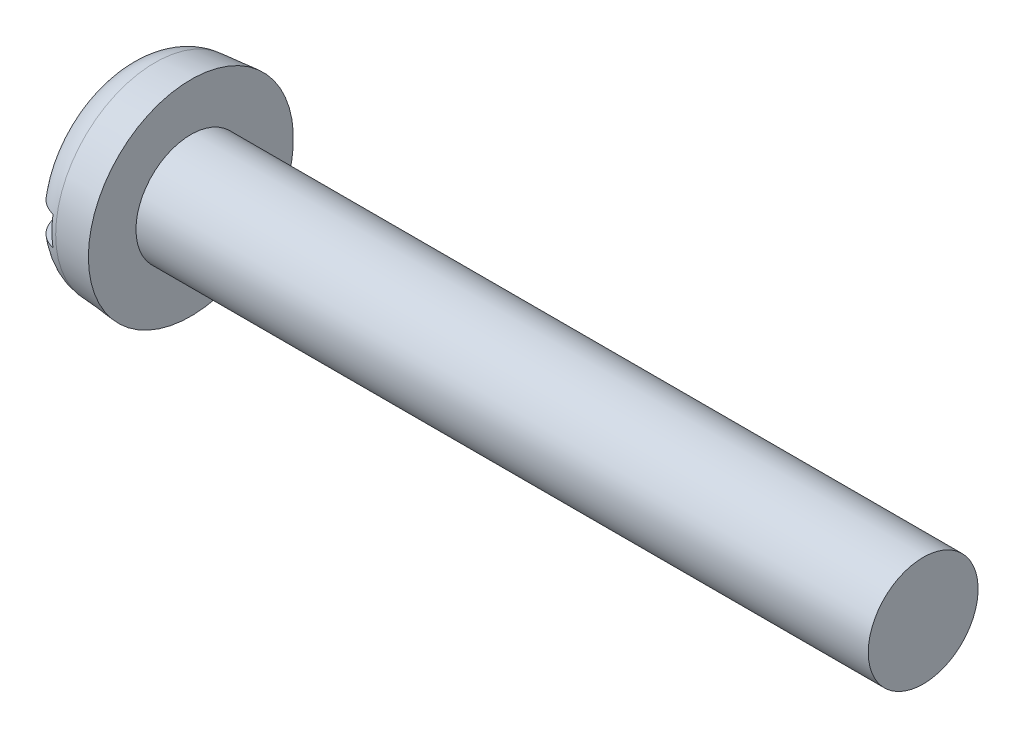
ISO-10303-21;
HEADER;
FILE_DESCRIPTION(('STEP AP214'),'2;1');
FILE_NAME('part.step','',(''),(''),'','','');
FILE_SCHEMA(('AUTOMOTIVE_DESIGN { 1 0 10303 214 1 1 1 1 }'));
ENDSEC;
DATA;
#1=APPLICATION_CONTEXT('core data for automotive mechanical design processes');
#2=APPLICATION_PROTOCOL_DEFINITION('international standard','automotive_design',2000,#1);
#3=PRODUCT_CONTEXT('',#1,'mechanical');
#4=PRODUCT('Part','Part','',(#3));
#5=PRODUCT_RELATED_PRODUCT_CATEGORY('part','',(#4));
#6=PRODUCT_DEFINITION_FORMATION('','',#4);
#7=PRODUCT_DEFINITION_CONTEXT('part definition',#1,'design');
#8=PRODUCT_DEFINITION('design','',#6,#7);
#9=PRODUCT_DEFINITION_SHAPE('','',#8);
#10=(LENGTH_UNIT() NAMED_UNIT(*) SI_UNIT(.MILLI.,.METRE.));
#11=(NAMED_UNIT(*) PLANE_ANGLE_UNIT() SI_UNIT($,.RADIAN.));
#12=(NAMED_UNIT(*) SI_UNIT($,.STERADIAN.) SOLID_ANGLE_UNIT());
#13=UNCERTAINTY_MEASURE_WITH_UNIT(LENGTH_MEASURE(1.E-05),#10,'distance_accuracy_value','');
#14=(GEOMETRIC_REPRESENTATION_CONTEXT(3) GLOBAL_UNCERTAINTY_ASSIGNED_CONTEXT((#13)) GLOBAL_UNIT_ASSIGNED_CONTEXT((#10,
#11,#12)) REPRESENTATION_CONTEXT('',''));
#15=CARTESIAN_POINT('',(0.,0.,0.));
#16=DIRECTION('',(0.,0.,1.));
#17=DIRECTION('',(1.,0.,0.));
#18=AXIS2_PLACEMENT_3D('',#15,#16,#17);
#19=CARTESIAN_POINT('',(0.,0.,0.));
#20=DIRECTION('',(-1.,0.,0.));
#21=DIRECTION('',(0.,0.,1.));
#22=AXIS2_PLACEMENT_3D('',#19,#20,#21);
#23=PLANE('',#22);
#24=DIRECTION('',(0.,0.,-1.));
#25=VECTOR('',#24,1.);
#26=CARTESIAN_POINT('',(0.,0.399999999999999,2.8));
#27=LINE('',#26,#25);
#28=CARTESIAN_POINT('',(0.,0.399999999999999,1.77326763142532));
#29=VERTEX_POINT('',#28);
#30=CARTESIAN_POINT('',(0.,0.399999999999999,-1.77326763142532));
#31=VERTEX_POINT('',#30);
#32=EDGE_CURVE('E85',#29,#31,#27,.T.);
#33=ORIENTED_EDGE('',*,*,#32,.F.);
#34=CARTESIAN_POINT('',(0.,0.,0.));
#35=DIRECTION('',(-1.,0.,0.));
#36=DIRECTION('',(0.,0.,1.));
#37=AXIS2_PLACEMENT_3D('',#34,#35,#36);
#38=CIRCLE('',#37,1.81782234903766);
#39=EDGE_CURVE('E91',#29,#31,#38,.T.);
#40=ORIENTED_EDGE('',*,*,#39,.T.);
#41=EDGE_LOOP('',(#33,#40));
#42=FACE_BOUND('',#41,.T.);
#43=ADVANCED_FACE('F32',(#42),#23,.T.);
#44=CARTESIAN_POINT('',(-25.4,0.,0.));
#45=DIRECTION('',(-1.,0.,0.));
#46=DIRECTION('',(0.,0.,1.));
#47=AXIS2_PLACEMENT_3D('',#44,#45,#46);
#48=CYLINDRICAL_SURFACE('',#47,1.5);
#49=CARTESIAN_POINT('',(21.8,0.,0.));
#50=DIRECTION('',(-1.,0.,0.));
#51=DIRECTION('',(0.,0.,1.));
#52=AXIS2_PLACEMENT_3D('',#49,#50,#51);
#53=CIRCLE('',#52,1.5);
#54=CARTESIAN_POINT('',(21.8,0.,1.5));
#55=VERTEX_POINT('',#54);
#56=EDGE_CURVE('E92',#55,#55,#53,.T.);
#57=ORIENTED_EDGE('',*,*,#56,.T.);
#58=EDGE_LOOP('',(#57));
#59=FACE_BOUND('',#58,.T.);
#60=CARTESIAN_POINT('',(1.8,0.,0.));
#61=DIRECTION('',(-1.,0.,0.));
#62=DIRECTION('',(0.,0.,1.));
#63=AXIS2_PLACEMENT_3D('',#60,#61,#62);
#64=CIRCLE('',#63,1.5);
#65=CARTESIAN_POINT('',(1.8,0.,1.5));
#66=VERTEX_POINT('',#65);
#67=EDGE_CURVE('E149',#66,#66,#64,.T.);
#68=ORIENTED_EDGE('',*,*,#67,.F.);
#69=EDGE_LOOP('',(#68));
#70=FACE_BOUND('',#69,.T.);
#71=ADVANCED_FACE('F137',(#59,#70),#48,.T.);
#72=CARTESIAN_POINT('',(21.8,1.5,0.));
#73=DIRECTION('',(1.,0.,0.));
#74=DIRECTION('',(0.,0.,-1.));
#75=AXIS2_PLACEMENT_3D('',#72,#73,#74);
#76=PLANE('',#75);
#77=ORIENTED_EDGE('',*,*,#56,.F.);
#78=EDGE_LOOP('',(#77));
#79=FACE_BOUND('',#78,.T.);
#80=ADVANCED_FACE('F135',(#79),#76,.T.);
#81=DIRECTION('',(0.,0.,1.));
#82=VECTOR('',#81,1.);
#83=CARTESIAN_POINT('',(0.,-0.4,-2.8));
#84=LINE('',#83,#82);
#85=CARTESIAN_POINT('',(0.,-0.4,-1.77326763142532));
#86=VERTEX_POINT('',#85);
#87=CARTESIAN_POINT('',(0.,-0.4,1.77326763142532));
#88=VERTEX_POINT('',#87);
#89=EDGE_CURVE('E76',#86,#88,#84,.T.);
#90=ORIENTED_EDGE('',*,*,#89,.F.);
#91=EDGE_CURVE('E83',#86,#88,#38,.T.);
#92=ORIENTED_EDGE('',*,*,#91,.T.);
#93=EDGE_LOOP('',(#90,#92));
#94=FACE_BOUND('',#93,.T.);
#95=ADVANCED_FACE('F82',(#94),#23,.T.);
#96=CARTESIAN_POINT('',(0.,0.,0.));
#97=DIRECTION('',(1.,0.,0.));
#98=DIRECTION('',(0.,0.,-1.));
#99=AXIS2_PLACEMENT_3D('',#96,#97,#98);
#100=CONICAL_SURFACE('',#99,2.64252040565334,0.087266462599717);
#101=CARTESIAN_POINT('',(0.821559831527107,0.,0.));
#102=DIRECTION('',(-1.,0.,0.));
#103=DIRECTION('',(0.,0.,1.));
#104=AXIS2_PLACEMENT_3D('',#101,#102,#103);
#105=CIRCLE('',#104,2.71439757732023);
#106=CARTESIAN_POINT('',(0.821559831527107,0.,2.71439757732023));
#107=VERTEX_POINT('',#106);
#108=EDGE_CURVE('E95',#107,#107,#105,.F.);
#109=ORIENTED_EDGE('',*,*,#108,.T.);
#110=EDGE_LOOP('',(#109));
#111=FACE_BOUND('',#110,.T.);
#112=CARTESIAN_POINT('',(1.8,0.,0.));
#113=DIRECTION('',(-1.,0.,0.));
#114=DIRECTION('',(0.,0.,1.));
#115=AXIS2_PLACEMENT_3D('',#112,#113,#114);
#116=CIRCLE('',#115,2.8);
#117=CARTESIAN_POINT('',(1.8,0.,2.8));
#118=VERTEX_POINT('',#117);
#119=EDGE_CURVE('E97',#118,#118,#116,.T.);
#120=ORIENTED_EDGE('',*,*,#119,.T.);
#121=EDGE_LOOP('',(#120));
#122=FACE_BOUND('',#121,.T.);
#123=ADVANCED_FACE('F128',(#111,#122),#100,.T.);
#124=CARTESIAN_POINT('',(1.8,1.5,0.));
#125=DIRECTION('',(-1.,0.,0.));
#126=DIRECTION('',(0.,0.,1.));
#127=AXIS2_PLACEMENT_3D('',#124,#125,#126);
#128=PLANE('',#127);
#129=ORIENTED_EDGE('',*,*,#119,.F.);
#130=EDGE_LOOP('',(#129));
#131=FACE_BOUND('',#130,.T.);
#132=ORIENTED_EDGE('',*,*,#67,.T.);
#133=EDGE_LOOP('',(#132));
#134=FACE_BOUND('',#133,.T.);
#135=ADVANCED_FACE('F124',(#131,#134),#128,.F.);
#136=CARTESIAN_POINT('',(0.9,0.,0.));
#137=DIRECTION('',(-1.,0.,0.));
#138=DIRECTION('',(0.,0.,1.));
#139=AXIS2_PLACEMENT_3D('',#136,#137,#138);
#140=TOROIDAL_SURFACE('',#139,1.81782234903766,0.9);
#141=CARTESIAN_POINT('',(0.285780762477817,0.399999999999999,-2.44311963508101));
#142=CARTESIAN_POINT('',(0.322325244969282,0.399999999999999,-2.47769297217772));
#143=CARTESIAN_POINT('',(0.361794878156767,0.399999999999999,-2.50922544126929));
#144=CARTESIAN_POINT('',(0.445493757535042,0.399999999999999,-2.56525291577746));
#145=CARTESIAN_POINT('',(0.48972822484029,0.399999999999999,-2.58974009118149));
#146=CARTESIAN_POINT('',(0.581685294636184,0.399999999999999,-2.63091846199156));
#147=CARTESIAN_POINT('',(0.629407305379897,0.399999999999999,-2.64761097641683));
#148=CARTESIAN_POINT('',(0.726972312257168,0.399999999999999,-2.67270033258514));
#149=CARTESIAN_POINT('',(0.776814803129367,0.399999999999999,-2.68109913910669));
#150=CARTESIAN_POINT('',(0.876977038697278,0.399999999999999,-2.68933922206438));
#151=CARTESIAN_POINT('',(0.92729364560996,0.399999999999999,-2.68921866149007));
#152=CARTESIAN_POINT('',(1.02719093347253,0.399999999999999,-2.68051830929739));
#153=CARTESIAN_POINT('',(1.07677160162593,0.399999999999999,-2.67193837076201));
#154=CARTESIAN_POINT('',(1.17371760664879,0.399999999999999,-2.6465919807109));
#155=CARTESIAN_POINT('',(1.2210859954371,0.399999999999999,-2.62983719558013));
#156=CARTESIAN_POINT('',(1.31235127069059,0.399999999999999,-2.58864040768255));
#157=CARTESIAN_POINT('',(1.35624813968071,0.399999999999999,-2.56419836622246));
#158=CARTESIAN_POINT('',(1.43950339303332,0.399999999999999,-2.50824069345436));
#159=CARTESIAN_POINT('',(1.47884484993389,0.399999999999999,-2.47669988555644));
#160=CARTESIAN_POINT('',(1.55173067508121,0.399999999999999,-2.40751412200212));
#161=CARTESIAN_POINT('',(1.5852748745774,0.399999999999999,-2.36986898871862));
#162=CARTESIAN_POINT('',(1.64594872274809,0.399999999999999,-2.28919528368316));
#163=CARTESIAN_POINT('',(1.67301846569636,0.399999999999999,-2.24612167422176));
#164=CARTESIAN_POINT('',(1.71966197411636,0.399999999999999,-2.15609376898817));
#165=CARTESIAN_POINT('',(1.73923530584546,0.399999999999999,-2.10913924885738));
#166=CARTESIAN_POINT('',(1.77066025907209,0.399999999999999,-2.01194193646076));
#167=CARTESIAN_POINT('',(1.78239254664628,0.399999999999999,-1.96166058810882));
#168=CARTESIAN_POINT('',(1.7974373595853,0.399999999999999,-1.85985639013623));
#169=CARTESIAN_POINT('',(1.80074908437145,0.399999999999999,-1.80833342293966));
#170=CARTESIAN_POINT('',(1.79894832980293,0.399999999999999,-1.70434405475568));
#171=CARTESIAN_POINT('',(1.79365584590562,0.399999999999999,-1.651880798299));
#172=CARTESIAN_POINT('',(1.77456092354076,0.399999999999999,-1.54852841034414));
#173=CARTESIAN_POINT('',(1.76075741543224,0.399999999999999,-1.49763947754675));
#174=CARTESIAN_POINT('',(1.7246504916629,0.399999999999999,-1.3975266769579));
#175=CARTESIAN_POINT('',(1.70214283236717,0.399999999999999,-1.34837644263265));
#176=CARTESIAN_POINT('',(1.64933120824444,0.399999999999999,-1.25444995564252));
#177=CARTESIAN_POINT('',(1.6190255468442,0.399999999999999,-1.20967465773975));
#178=CARTESIAN_POINT('',(1.55085214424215,0.399999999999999,-1.12504927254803));
#179=CARTESIAN_POINT('',(1.51286662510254,0.399999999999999,-1.08529386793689));
#180=CARTESIAN_POINT('',(1.4306134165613,0.399999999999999,-1.01288372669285));
#181=CARTESIAN_POINT('',(1.38634513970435,0.399999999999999,-0.980229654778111));
#182=CARTESIAN_POINT('',(1.29378824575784,0.399999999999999,-0.924048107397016));
#183=CARTESIAN_POINT('',(1.24562231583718,0.399999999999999,-0.900319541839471));
#184=CARTESIAN_POINT('',(1.14574424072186,0.399999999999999,-0.862177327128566));
#185=CARTESIAN_POINT('',(1.09403573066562,0.399999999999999,-0.847754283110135));
#186=CARTESIAN_POINT('',(0.993395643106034,0.399999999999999,-0.830011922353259));
#187=CARTESIAN_POINT('',(0.944615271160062,0.399999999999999,-0.825833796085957));
#188=CARTESIAN_POINT('',(0.847107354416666,0.399999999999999,-0.826334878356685));
#189=CARTESIAN_POINT('',(0.798379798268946,0.399999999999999,-0.831011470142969));
#190=CARTESIAN_POINT('',(0.705495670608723,0.399999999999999,-0.848340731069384));
#191=CARTESIAN_POINT('',(0.661242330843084,0.399999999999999,-0.860484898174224));
#192=CARTESIAN_POINT('',(0.575232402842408,0.399999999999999,-0.891650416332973));
#193=CARTESIAN_POINT('',(0.53347652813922,0.399999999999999,-0.910673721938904));
#194=CARTESIAN_POINT('',(0.451191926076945,0.399999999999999,-0.956010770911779));
#195=CARTESIAN_POINT('',(0.410848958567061,0.399999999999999,-0.982660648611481));
#196=CARTESIAN_POINT('',(0.334722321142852,0.399999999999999,-1.04182188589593));
#197=CARTESIAN_POINT('',(0.298940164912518,0.399999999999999,-1.0743351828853));
#198=CARTESIAN_POINT('',(0.229649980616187,0.399999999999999,-1.14749226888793));
#199=CARTESIAN_POINT('',(0.19663491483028,0.399999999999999,-1.18860403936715));
#200=CARTESIAN_POINT('',(0.137645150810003,0.399999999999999,-1.27560624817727));
#201=CARTESIAN_POINT('',(0.111672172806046,0.399999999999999,-1.32149785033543));
#202=CARTESIAN_POINT('',(0.0665593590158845,0.399999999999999,-1.41881690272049));
#203=CARTESIAN_POINT('',(0.0477401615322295,0.399999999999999,-1.47039354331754));
#204=CARTESIAN_POINT('',(0.0191028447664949,0.399999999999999,-1.57598967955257));
#205=CARTESIAN_POINT('',(0.0092842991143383,0.399999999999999,-1.63000905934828));
#206=CARTESIAN_POINT('',(-0.000908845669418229,0.399999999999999,-1.73850050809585));
#207=CARTESIAN_POINT('',(-0.00135843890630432,0.399999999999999,-1.7929654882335));
#208=CARTESIAN_POINT('',(0.00713794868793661,0.399999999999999,-1.90117587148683));
#209=CARTESIAN_POINT('',(0.0160852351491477,0.399999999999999,-1.9549211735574));
#210=CARTESIAN_POINT('',(0.0428869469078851,0.399999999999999,-2.05874477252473));
#211=CARTESIAN_POINT('',(0.0605196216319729,0.399999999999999,-2.10888044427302));
#212=CARTESIAN_POINT('',(0.104140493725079,0.399999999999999,-2.20532358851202));
#213=CARTESIAN_POINT('',(0.130117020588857,0.399999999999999,-2.25163629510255));
#214=CARTESIAN_POINT('',(0.178150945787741,0.399999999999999,-2.32211375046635));
#215=CARTESIAN_POINT('',(0.197843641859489,0.399999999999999,-2.34792122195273));
#216=CARTESIAN_POINT('',(0.239879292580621,0.399999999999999,-2.39728022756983));
#217=CARTESIAN_POINT('',(0.26222221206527,0.399999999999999,-2.42083179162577));
#218=CARTESIAN_POINT('',(0.285780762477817,0.399999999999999,-2.44311963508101));
#219=B_SPLINE_CURVE_WITH_KNOTS('',3,(#141,#142,#143,#144,#145,#146,#147,#148,#149,#150,#151,
#152,#153,#154,#155,#156,#157,#158,#159,#160,#161,#162,#163,#164,#165,#166,#167,#168,#169,#170,
#171,#172,#173,#174,#175,#176,#177,#178,#179,#180,#181,#182,#183,#184,#185,#186,#187,#188,#189,
#190,#191,#192,#193,#194,#195,#196,#197,#198,#199,#200,#201,#202,#203,#204,#205,#206,#207,#208,
#209,#210,#211,#212,#213,#214,#215,#216,#217,#218),.UNSPECIFIED.,.T.,.F.,(4,2,2,2,2,2,2,2,2,2,2,
2,2,2,2,2,2,2,2,2,2,2,2,2,2,2,2,2,2,2,2,2,2,2,2,2,2,2,4),(0.,0.15080428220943,0.301775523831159,
0.452721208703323,0.603631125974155,0.753865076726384,0.904101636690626,1.05412441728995,
1.2041479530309,1.35471219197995,1.50528081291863,1.65719291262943,1.80911380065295,
1.96329712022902,2.11749509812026,2.27496068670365,2.43244606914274,2.59387611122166,
2.75534130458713,2.9195015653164,3.08367718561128,3.24389389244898,3.40394859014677,
3.55004213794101,3.69609251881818,3.83315592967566,3.97025831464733,4.11470991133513,
4.25920932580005,4.41668805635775,4.57420522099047,4.73812462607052,4.90203626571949,
5.06463536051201,5.22725705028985,5.38592661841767,5.54437521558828,5.64159310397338,
5.73880970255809),.UNSPECIFIED.);
#220=CARTESIAN_POINT('',(0.7,0.399999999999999,-2.66547244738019));
#221=VERTEX_POINT('',#220);
#222=EDGE_CURVE('E11',#31,#221,#219,.T.);
#223=ORIENTED_EDGE('',*,*,#222,.F.);
#224=ORIENTED_EDGE('',*,*,#39,.F.);
#225=CARTESIAN_POINT('',(0.356169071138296,0.399999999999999,1.02545886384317));
#226=CARTESIAN_POINT('',(0.394477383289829,0.399999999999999,0.994276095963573));
#227=CARTESIAN_POINT('',(0.435252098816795,0.399999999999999,0.966090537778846));
#228=CARTESIAN_POINT('',(0.520874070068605,0.399999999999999,0.916713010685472));
#229=CARTESIAN_POINT('',(0.56572297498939,0.399999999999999,0.895523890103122));
#230=CARTESIAN_POINT('',(0.658585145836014,0.399999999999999,0.861072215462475));
#231=CARTESIAN_POINT('',(0.706609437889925,0.399999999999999,0.84783908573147));
#232=CARTESIAN_POINT('',(0.80424325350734,0.399999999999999,0.83024223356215));
#233=CARTESIAN_POINT('',(0.853851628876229,0.399999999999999,0.825872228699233));
#234=CARTESIAN_POINT('',(0.950010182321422,0.399999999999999,0.826277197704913));
#235=CARTESIAN_POINT('',(0.99656347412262,0.399999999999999,0.830513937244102));
#236=CARTESIAN_POINT('',(1.08828168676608,0.399999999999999,0.846797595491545));
#237=CARTESIAN_POINT('',(1.1334463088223,0.399999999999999,0.858846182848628));
#238=CARTESIAN_POINT('',(1.22099947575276,0.399999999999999,0.890027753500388));
#239=CARTESIAN_POINT('',(1.26339999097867,0.399999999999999,0.909127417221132));
#240=CARTESIAN_POINT('',(1.34475562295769,0.399999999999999,0.953613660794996));
#241=CARTESIAN_POINT('',(1.38370973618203,0.399999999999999,0.979002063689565));
#242=CARTESIAN_POINT('',(1.4606297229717,0.399999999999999,1.03768873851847));
#243=CARTESIAN_POINT('',(1.49821861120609,0.399999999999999,1.07148126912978));
#244=CARTESIAN_POINT('',(1.56766557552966,0.399999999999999,1.14451739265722));
#245=CARTESIAN_POINT('',(1.59952174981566,0.399999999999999,1.18376278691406));
#246=CARTESIAN_POINT('',(1.65882951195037,0.399999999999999,1.26965174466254));
#247=CARTESIAN_POINT('',(1.68580874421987,0.399999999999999,1.3166225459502));
#248=CARTESIAN_POINT('',(1.7316261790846,0.399999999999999,1.41438438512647));
#249=CARTESIAN_POINT('',(1.7504634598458,0.399999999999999,1.46517585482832));
#250=CARTESIAN_POINT('',(1.77959171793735,0.399999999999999,1.56990546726));
#251=CARTESIAN_POINT('',(1.78976336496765,0.399999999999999,1.62387693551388));
#252=CARTESIAN_POINT('',(1.80070617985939,0.399999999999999,1.73276786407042));
#253=CARTESIAN_POINT('',(1.80147810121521,0.399999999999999,1.78768724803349));
#254=CARTESIAN_POINT('',(1.7935515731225,0.399999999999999,1.89576039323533));
#255=CARTESIAN_POINT('',(1.78503812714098,0.399999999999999,1.94892767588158));
#256=CARTESIAN_POINT('',(1.75897009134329,0.399999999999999,2.05299963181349));
#257=CARTESIAN_POINT('',(1.74141670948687,0.399999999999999,2.10390460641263));
#258=CARTESIAN_POINT('',(1.69825810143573,0.399999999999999,2.20064023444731));
#259=CARTESIAN_POINT('',(1.67286703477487,0.399999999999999,2.24656646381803));
#260=CARTESIAN_POINT('',(1.61458416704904,0.399999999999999,2.33338474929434));
#261=CARTESIAN_POINT('',(1.58169323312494,0.399999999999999,2.37427738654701));
#262=CARTESIAN_POINT('',(1.51007060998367,0.399999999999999,2.44900649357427));
#263=CARTESIAN_POINT('',(1.47146964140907,0.399999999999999,2.48296829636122));
#264=CARTESIAN_POINT('',(1.38904817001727,0.399999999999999,2.54382334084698));
#265=CARTESIAN_POINT('',(1.34522808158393,0.399999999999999,2.57071714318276));
#266=CARTESIAN_POINT('',(1.25424836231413,0.399999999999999,2.61630908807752));
#267=CARTESIAN_POINT('',(1.20714119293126,0.399999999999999,2.63511196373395));
#268=CARTESIAN_POINT('',(1.11042474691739,0.399999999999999,2.66447616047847));
#269=CARTESIAN_POINT('',(1.06081558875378,0.399999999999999,2.67503787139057));
#270=CARTESIAN_POINT('',(0.960893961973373,0.399999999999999,2.68755622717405));
#271=CARTESIAN_POINT('',(0.910589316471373,0.399999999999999,2.68957539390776));
#272=CARTESIAN_POINT('',(0.810358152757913,0.399999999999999,2.68512046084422));
#273=CARTESIAN_POINT('',(0.760431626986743,0.399999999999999,2.67864653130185));
#274=CARTESIAN_POINT('',(0.662478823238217,0.399999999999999,2.65741995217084));
#275=CARTESIAN_POINT('',(0.614448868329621,0.399999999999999,2.64268425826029));
#276=CARTESIAN_POINT('',(0.521534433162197,0.399999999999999,2.60538142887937));
#277=CARTESIAN_POINT('',(0.476649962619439,0.399999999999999,2.58281426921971));
#278=CARTESIAN_POINT('',(0.391148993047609,0.399999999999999,2.53043182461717));
#279=CARTESIAN_POINT('',(0.350545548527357,0.399999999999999,2.50059523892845));
#280=CARTESIAN_POINT('',(0.274874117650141,0.399999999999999,2.43457977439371));
#281=CARTESIAN_POINT('',(0.239806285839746,0.399999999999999,2.39840071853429));
#282=CARTESIAN_POINT('',(0.1758792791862,0.399999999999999,2.32042102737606));
#283=CARTESIAN_POINT('',(0.147073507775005,0.399999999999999,2.27857662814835));
#284=CARTESIAN_POINT('',(0.0967847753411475,0.399999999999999,2.19069995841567));
#285=CARTESIAN_POINT('',(0.07530224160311,0.399999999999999,2.14466744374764));
#286=CARTESIAN_POINT('',(0.0399276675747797,0.399999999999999,2.04903409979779));
#287=CARTESIAN_POINT('',(0.0261471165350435,0.399999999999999,1.99939205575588));
#288=CARTESIAN_POINT('',(0.00693602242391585,0.399999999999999,1.89852251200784));
#289=CARTESIAN_POINT('',(0.00150590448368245,0.399999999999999,1.84729493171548));
#290=CARTESIAN_POINT('',(-0.000985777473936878,0.399999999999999,1.74359522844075));
#291=CARTESIAN_POINT('',(0.0021251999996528,0.399999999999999,1.69111899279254));
#292=CARTESIAN_POINT('',(0.0168916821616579,0.399999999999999,1.58737297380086));
#293=CARTESIAN_POINT('',(0.0285499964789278,0.399999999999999,1.53610359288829));
#294=CARTESIAN_POINT('',(0.0604020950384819,0.399999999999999,1.43486374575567));
#295=CARTESIAN_POINT('',(0.080804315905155,0.399999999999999,1.38495893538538));
#296=CARTESIAN_POINT('',(0.129530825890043,0.399999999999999,1.28921347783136));
#297=CARTESIAN_POINT('',(0.157849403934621,0.399999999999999,1.24336993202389));
#298=CARTESIAN_POINT('',(0.213684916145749,0.399999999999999,1.16773658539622));
#299=CARTESIAN_POINT('',(0.239651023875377,0.399999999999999,1.13678903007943));
#300=CARTESIAN_POINT('',(0.29525297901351,0.399999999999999,1.07838116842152));
#301=CARTESIAN_POINT('',(0.324888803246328,0.399999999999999,1.05092084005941));
#302=CARTESIAN_POINT('',(0.356169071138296,0.399999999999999,1.02545886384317));
#303=B_SPLINE_CURVE_WITH_KNOTS('',3,(#225,#226,#227,#228,#229,#230,#231,#232,#233,#234,#235,
#236,#237,#238,#239,#240,#241,#242,#243,#244,#245,#246,#247,#248,#249,#250,#251,#252,#253,#254,
#255,#256,#257,#258,#259,#260,#261,#262,#263,#264,#265,#266,#267,#268,#269,#270,#271,#272,#273,
#274,#275,#276,#277,#278,#279,#280,#281,#282,#283,#284,#285,#286,#287,#288,#289,#290,#291,#292,
#293,#294,#295,#296,#297,#298,#299,#300,#301,#302),.UNSPECIFIED.,.T.,.F.,(4,2,2,2,2,2,2,2,2,2,2,
2,2,2,2,2,2,2,2,2,2,2,2,2,2,2,2,2,2,2,2,2,2,2,2,2,2,2,4),(0.,0.148056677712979,
0.296173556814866,0.444834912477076,0.593390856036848,0.732942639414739,0.87252424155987,
1.01145452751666,1.15042513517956,1.30141738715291,1.45245963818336,1.61420969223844,
1.7759780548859,1.93993961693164,2.10388803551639,2.26462860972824,2.42534771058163,
2.58201478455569,2.73866375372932,2.89216335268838,3.04565077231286,3.19708679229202,
3.34851564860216,3.49883427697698,3.64914989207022,3.79915813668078,3.94916684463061,
4.09962050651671,4.25007836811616,4.40177296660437,4.55347641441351,4.70732244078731,
4.86117629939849,5.0181609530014,5.17519723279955,5.33620557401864,5.49709805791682,
5.61799301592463,5.73888721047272),.UNSPECIFIED.);
#304=CARTESIAN_POINT('',(0.7,0.399999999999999,2.66547244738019));
#305=VERTEX_POINT('',#304);
#306=EDGE_CURVE('E109',#305,#29,#303,.T.);
#307=ORIENTED_EDGE('',*,*,#306,.F.);
#308=CARTESIAN_POINT('',(0.7,0.,0.));
#309=DIRECTION('',(-1.,0.,0.));
#310=DIRECTION('',(0.,0.,1.));
#311=AXIS2_PLACEMENT_3D('',#308,#309,#310);
#312=CIRCLE('',#311,2.69531878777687);
#313=CARTESIAN_POINT('',(0.7,-0.4,2.66547244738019));
#314=VERTEX_POINT('',#313);
#315=EDGE_CURVE('E103',#305,#314,#312,.F.);
#316=ORIENTED_EDGE('',*,*,#315,.T.);
#317=CARTESIAN_POINT('',(0.356169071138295,-0.4,1.02545886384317));
#318=CARTESIAN_POINT('',(0.314031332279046,-0.4,1.05976167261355));
#319=CARTESIAN_POINT('',(0.274819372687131,-0.4,1.0977427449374));
#320=CARTESIAN_POINT('',(0.20326819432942,-0.4,1.17978565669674));
#321=CARTESIAN_POINT('',(0.170942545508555,-0.4,1.22385922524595));
#322=CARTESIAN_POINT('',(0.114111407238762,-0.4,1.31672727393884));
#323=CARTESIAN_POINT('',(0.0895968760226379,-0.4,1.36551620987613));
#324=CARTESIAN_POINT('',(0.0490785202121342,-0.4,1.46648183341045));
#325=CARTESIAN_POINT('',(0.0330703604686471,-0.4,1.51865678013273));
#326=CARTESIAN_POINT('',(0.0100453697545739,-0.4,1.62518908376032));
#327=CARTESIAN_POINT('',(0.00306618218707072,-0.4,1.67955460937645));
#328=CARTESIAN_POINT('',(-0.00144685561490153,-0.4,1.78868546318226));
#329=CARTESIAN_POINT('',(0.00101939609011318,-0.4,1.84345079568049));
#330=CARTESIAN_POINT('',(0.0152891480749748,-0.4,1.95052330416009));
#331=CARTESIAN_POINT('',(0.0268854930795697,-0.4,2.0028580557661));
#332=CARTESIAN_POINT('',(0.0589248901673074,-0.4,2.10474672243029));
#333=CARTESIAN_POINT('',(0.0793666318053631,-0.4,2.15430104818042));
#334=CARTESIAN_POINT('',(0.12795627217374,-0.4,2.24792186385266));
#335=CARTESIAN_POINT('',(0.155901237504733,-0.4,2.29209371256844));
#336=CARTESIAN_POINT('',(0.218944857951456,-0.4,2.37499861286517));
#337=CARTESIAN_POINT('',(0.254042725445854,-0.4,2.41373226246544));
#338=CARTESIAN_POINT('',(0.32966685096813,-0.4,2.48389534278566));
#339=CARTESIAN_POINT('',(0.370077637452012,-0.4,2.51544927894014));
#340=CARTESIAN_POINT('',(0.455677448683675,-0.4,2.57122459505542));
#341=CARTESIAN_POINT('',(0.500866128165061,-0.4,2.59544650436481));
#342=CARTESIAN_POINT('',(0.59413782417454,-0.4,2.6355729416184));
#343=CARTESIAN_POINT('',(0.642178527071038,-0.4,2.65157587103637));
#344=CARTESIAN_POINT('',(0.740273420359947,-0.4,2.67523109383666));
#345=CARTESIAN_POINT('',(0.790327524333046,-0.4,2.68288374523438));
#346=CARTESIAN_POINT('',(0.890686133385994,-0.4,2.68958762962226));
#347=CARTESIAN_POINT('',(0.940986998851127,-0.4,2.68869347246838));
#348=CARTESIAN_POINT('',(1.04072178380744,-0.4,2.67846167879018));
#349=CARTESIAN_POINT('',(1.0901557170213,-0.4,2.66912417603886));
#350=CARTESIAN_POINT('',(1.18669599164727,-0.4,2.64229877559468));
#351=CARTESIAN_POINT('',(1.23380501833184,-0.4,2.6248205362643));
#352=CARTESIAN_POINT('',(1.32443528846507,-0.4,2.58223220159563));
#353=CARTESIAN_POINT('',(1.36795650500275,-0.4,2.5571220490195));
#354=CARTESIAN_POINT('',(1.45036421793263,-0.4,2.49989362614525));
#355=CARTESIAN_POINT('',(1.48923230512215,-0.4,2.46774885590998));
#356=CARTESIAN_POINT('',(1.56107927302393,-0.4,2.39744378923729));
#357=CARTESIAN_POINT('',(1.59405796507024,-0.4,2.35928330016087));
#358=CARTESIAN_POINT('',(1.65352847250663,-0.4,2.2776666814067));
#359=CARTESIAN_POINT('',(1.67995797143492,-0.4,2.23416516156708));
#360=CARTESIAN_POINT('',(1.72526137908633,-0.4,2.14339421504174));
#361=CARTESIAN_POINT('',(1.74413484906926,-0.4,2.09612456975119));
#362=CARTESIAN_POINT('',(1.77411508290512,-0.4,1.9983989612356));
#363=CARTESIAN_POINT('',(1.78509960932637,-0.4,1.9479055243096));
#364=CARTESIAN_POINT('',(1.79862667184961,-0.4,1.84580292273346));
#365=CARTESIAN_POINT('',(1.80116838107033,-0.4,1.79419364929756));
#366=CARTESIAN_POINT('',(1.79780993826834,-0.4,1.69014314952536));
#367=CARTESIAN_POINT('',(1.79172746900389,-0.4,1.63770783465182));
#368=CARTESIAN_POINT('',(1.77106806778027,-0.4,1.53454005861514));
#369=CARTESIAN_POINT('',(1.75649007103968,-0.4,1.48380781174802));
#370=CARTESIAN_POINT('',(1.7188487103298,-0.4,1.38413781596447));
#371=CARTESIAN_POINT('',(1.69558194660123,-0.4,1.33527684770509));
#372=CARTESIAN_POINT('',(1.64130257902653,-0.4,1.24205401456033));
#373=CARTESIAN_POINT('',(1.6102882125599,-0.4,1.19769317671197));
#374=CARTESIAN_POINT('',(1.54078360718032,-0.4,1.11407031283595));
#375=CARTESIAN_POINT('',(1.50218355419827,-0.4,1.07489936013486));
#376=CARTESIAN_POINT('',(1.418793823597,-0.4,1.00377929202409));
#377=CARTESIAN_POINT('',(1.37400377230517,-0.4,0.971830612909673));
#378=CARTESIAN_POINT('',(1.28066227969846,-0.4,0.917245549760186));
#379=CARTESIAN_POINT('',(1.23224470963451,-0.4,0.894381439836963));
#380=CARTESIAN_POINT('',(1.13202516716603,-0.4,0.858023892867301));
#381=CARTESIAN_POINT('',(1.08022692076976,-0.4,0.844520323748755));
#382=CARTESIAN_POINT('',(0.979686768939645,-0.4,0.828554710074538));
#383=CARTESIAN_POINT('',(0.93108358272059,-0.4,0.82521631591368));
#384=CARTESIAN_POINT('',(0.834057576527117,-0.4,0.827306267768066));
#385=CARTESIAN_POINT('',(0.785634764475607,-0.4,0.832734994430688));
#386=CARTESIAN_POINT('',(0.693219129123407,-0.4,0.851440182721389));
#387=CARTESIAN_POINT('',(0.6491307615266,-0.4,0.864254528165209));
#388=CARTESIAN_POINT('',(0.563580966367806,-0.4,0.896690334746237));
#389=CARTESIAN_POINT('',(0.522117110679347,-0.4,0.916305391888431));
#390=CARTESIAN_POINT('',(0.460201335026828,-0.4,0.951554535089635));
#391=CARTESIAN_POINT('',(0.438547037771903,-0.4,0.965129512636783));
#392=CARTESIAN_POINT('',(0.396436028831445,-0.4,0.994018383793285));
#393=CARTESIAN_POINT('',(0.375979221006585,-0.4,1.00933213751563));
#394=CARTESIAN_POINT('',(0.356169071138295,-0.4,1.02545886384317));
#395=B_SPLINE_CURVE_WITH_KNOTS('',3,(#317,#318,#319,#320,#321,#322,#323,#324,#325,#326,#327,
#328,#329,#330,#331,#332,#333,#334,#335,#336,#337,#338,#339,#340,#341,#342,#343,#344,#345,#346,
#347,#348,#349,#350,#351,#352,#353,#354,#355,#356,#357,#358,#359,#360,#361,#362,#363,#364,#365,
#366,#367,#368,#369,#370,#371,#372,#373,#374,#375,#376,#377,#378,#379,#380,#381,#382,#383,#384,
#385,#386,#387,#388,#389,#390,#391,#392,#393,#394),.UNSPECIFIED.,.T.,.F.,(4,2,2,2,2,2,2,2,2,2,2,
2,2,2,2,2,2,2,2,2,2,2,2,2,2,2,2,2,2,2,2,2,2,2,2,2,2,2,4),(0.,0.162908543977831,
0.326135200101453,0.489172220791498,0.652126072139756,0.815757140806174,0.979389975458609,
1.13941349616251,1.29941331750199,1.45545894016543,1.61148738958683,1.76455910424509,
1.91761976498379,2.068802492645,2.21997873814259,2.37018969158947,2.52039826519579,
2.67042907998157,2.82046101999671,2.97106818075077,3.12168016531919,3.27367450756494,
3.42567767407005,3.5799880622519,3.73431356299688,3.89195060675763,4.04960741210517,
4.2112132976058,4.37285598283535,4.53703863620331,4.70123120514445,4.86099956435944,
5.02059471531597,5.16597452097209,5.31136063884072,5.44850857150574,5.58552770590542,
5.66212180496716,5.73870974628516),.UNSPECIFIED.);
#396=EDGE_CURVE('E90',#88,#314,#395,.T.);
#397=ORIENTED_EDGE('',*,*,#396,.F.);
#398=ORIENTED_EDGE('',*,*,#91,.F.);
#399=CARTESIAN_POINT('',(0.285780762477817,-0.4,-2.44311963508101));
#400=CARTESIAN_POINT('',(0.248557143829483,-0.4,-2.4078972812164));
#401=CARTESIAN_POINT('',(0.214312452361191,-0.4,-2.3694650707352));
#402=CARTESIAN_POINT('',(0.152768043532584,-0.4,-2.28733938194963));
#403=CARTESIAN_POINT('',(0.125478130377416,-0.4,-2.24363860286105));
#404=CARTESIAN_POINT('',(0.0786257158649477,-0.4,-2.15234079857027));
#405=CARTESIAN_POINT('',(0.0590537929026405,-0.4,-2.10474861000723));
#406=CARTESIAN_POINT('',(0.0280650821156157,-0.4,-2.00700047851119));
#407=CARTESIAN_POINT('',(0.0166461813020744,-0.4,-1.95684520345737));
#408=CARTESIAN_POINT('',(0.00206923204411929,-0.4,-1.85464080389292));
#409=CARTESIAN_POINT('',(-0.000972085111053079,-0.4,-1.80257506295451));
#410=CARTESIAN_POINT('',(0.00151453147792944,-0.4,-1.69864852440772));
#411=CARTESIAN_POINT('',(0.00704382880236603,-0.4,-1.64678776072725));
#412=CARTESIAN_POINT('',(0.0266516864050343,-0.4,-1.5434240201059));
#413=CARTESIAN_POINT('',(0.0409314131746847,-0.4,-1.49195921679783));
#414=CARTESIAN_POINT('',(0.0777275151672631,-0.4,-1.39206285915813));
#415=CARTESIAN_POINT('',(0.100245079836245,-0.4,-1.34363174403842));
#416=CARTESIAN_POINT('',(0.153482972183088,-0.4,-1.2500005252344));
#417=CARTESIAN_POINT('',(0.184382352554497,-0.4,-1.20490211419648));
#418=CARTESIAN_POINT('',(0.253306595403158,-0.4,-1.12049761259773));
#419=CARTESIAN_POINT('',(0.29133345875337,-0.4,-1.08119315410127));
#420=CARTESIAN_POINT('',(0.373599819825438,-0.4,-1.00962170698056));
#421=CARTESIAN_POINT('',(0.417845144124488,-0.4,-0.977361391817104));
#422=CARTESIAN_POINT('',(0.511393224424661,-0.4,-0.921257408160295));
#423=CARTESIAN_POINT('',(0.560693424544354,-0.4,-0.897409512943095));
#424=CARTESIAN_POINT('',(0.659899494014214,-0.4,-0.86056620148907));
#425=CARTESIAN_POINT('',(0.709596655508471,-0.4,-0.847011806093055));
#426=CARTESIAN_POINT('',(0.81063175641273,-0.4,-0.829407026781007));
#427=CARTESIAN_POINT('',(0.861968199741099,-0.4,-0.825348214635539));
#428=CARTESIAN_POINT('',(0.959752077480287,-0.4,-0.82693832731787));
#429=CARTESIAN_POINT('',(1.00621575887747,-0.4,-0.831730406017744));
#430=CARTESIAN_POINT('',(1.09766854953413,-0.4,-0.849077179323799));
#431=CARTESIAN_POINT('',(1.14265739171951,-0.4,-0.861633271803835));
#432=CARTESIAN_POINT('',(1.2299114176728,-0.4,-0.893807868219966));
#433=CARTESIAN_POINT('',(1.27218175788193,-0.4,-0.913412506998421));
#434=CARTESIAN_POINT('',(1.35320643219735,-0.4,-0.958874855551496));
#435=CARTESIAN_POINT('',(1.39195973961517,-0.4,-0.984734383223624));
#436=CARTESIAN_POINT('',(1.46843970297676,-0.4,-1.04440221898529));
#437=CARTESIAN_POINT('',(1.5057776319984,-0.4,-1.07870901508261));
#438=CARTESIAN_POINT('',(1.57463408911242,-0.4,-1.15273784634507));
#439=CARTESIAN_POINT('',(1.60615068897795,-0.4,-1.19246166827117));
#440=CARTESIAN_POINT('',(1.66460952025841,-0.4,-1.27921419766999));
#441=CARTESIAN_POINT('',(1.69108592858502,-0.4,-1.32655784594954));
#442=CARTESIAN_POINT('',(1.73582713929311,-0.4,-1.42498260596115));
#443=CARTESIAN_POINT('',(1.75409110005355,-0.4,-1.47606410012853));
#444=CARTESIAN_POINT('',(1.7819800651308,-0.4,-1.58118959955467));
#445=CARTESIAN_POINT('',(1.79150042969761,-0.4,-1.63526148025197));
#446=CARTESIAN_POINT('',(1.80112725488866,-0.4,-1.74424014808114));
#447=CARTESIAN_POINT('',(1.80123449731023,-0.4,-1.79914686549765));
#448=CARTESIAN_POINT('',(1.79200090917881,-0.4,-1.90704889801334));
#449=CARTESIAN_POINT('',(1.78285023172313,-0.4,-1.96006044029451));
#450=CARTESIAN_POINT('',(1.75554489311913,-0.4,-2.06371351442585));
#451=CARTESIAN_POINT('',(1.73739144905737,-0.4,-2.11435536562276));
#452=CARTESIAN_POINT('',(1.69310212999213,-0.4,-2.21047686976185));
#453=CARTESIAN_POINT('',(1.66717834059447,-0.4,-2.25605427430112));
#454=CARTESIAN_POINT('',(1.60789945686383,-0.4,-2.34209023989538));
#455=CARTESIAN_POINT('',(1.57454519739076,-0.4,-2.38254937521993));
#456=CARTESIAN_POINT('',(1.50207992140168,-0.4,-2.45635864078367));
#457=CARTESIAN_POINT('',(1.46309647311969,-0.4,-2.48983406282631));
#458=CARTESIAN_POINT('',(1.37999946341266,-0.4,-2.54966020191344));
#459=CARTESIAN_POINT('',(1.33588629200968,-0.4,-2.57601146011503));
#460=CARTESIAN_POINT('',(1.24441048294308,-0.4,-2.6204920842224));
#461=CARTESIAN_POINT('',(1.19709806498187,-0.4,-2.63872477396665));
#462=CARTESIAN_POINT('',(1.10007286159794,-0.4,-2.66692299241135));
#463=CARTESIAN_POINT('',(1.05036028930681,-0.4,-2.67688925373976));
#464=CARTESIAN_POINT('',(0.950330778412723,-0.4,-2.68821568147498));
#465=CARTESIAN_POINT('',(0.900020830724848,-0.4,-2.68963769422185));
#466=CARTESIAN_POINT('',(0.799864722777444,-0.4,-2.68399705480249));
#467=CARTESIAN_POINT('',(0.75001868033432,-0.4,-2.67693230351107));
#468=CARTESIAN_POINT('',(0.652295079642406,-0.4,-2.6545442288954));
#469=CARTESIAN_POINT('',(0.6044149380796,-0.4,-2.63923214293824));
#470=CARTESIAN_POINT('',(0.511939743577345,-0.4,-2.60081753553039));
#471=CARTESIAN_POINT('',(0.467340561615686,-0.4,-2.5777250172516));
#472=CARTESIAN_POINT('',(0.40010178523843,-0.4,-2.53543999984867));
#473=CARTESIAN_POINT('',(0.375979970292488,-0.4,-2.51855507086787));
#474=CARTESIAN_POINT('',(0.329505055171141,-0.4,-2.48250598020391));
#475=CARTESIAN_POINT('',(0.307151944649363,-0.4,-2.46334183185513));
#476=CARTESIAN_POINT('',(0.285780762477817,-0.4,-2.44311963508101));
#477=B_SPLINE_CURVE_WITH_KNOTS('',3,(#399,#400,#401,#402,#403,#404,#405,#406,#407,#408,#409,
#410,#411,#412,#413,#414,#415,#416,#417,#418,#419,#420,#421,#422,#423,#424,#425,#426,#427,#428,
#429,#430,#431,#432,#433,#434,#435,#436,#437,#438,#439,#440,#441,#442,#443,#444,#445,#446,#447,
#448,#449,#450,#451,#452,#453,#454,#455,#456,#457,#458,#459,#460,#461,#462,#463,#464,#465,#466,
#467,#468,#469,#470,#471,#472,#473,#474,#475,#476),.UNSPECIFIED.,.T.,.F.,(4,2,2,2,2,2,2,2,2,2,2,
2,2,2,2,2,2,2,2,2,2,2,2,2,2,2,2,2,2,2,2,2,2,2,2,2,2,2,4),(0.,0.153630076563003,0.30747554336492,
0.461132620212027,0.614749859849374,0.770496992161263,0.926268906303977,1.08576372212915,
1.24528157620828,1.40851960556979,1.57180352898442,1.73524147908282,1.89859719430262,
2.05228040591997,2.205827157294,2.34528036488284,2.48475868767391,2.62396413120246,
2.7632100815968,2.91467905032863,3.06619810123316,3.22817436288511,3.39016722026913,
3.55407439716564,3.71796796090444,3.87856222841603,4.03913479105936,4.19567175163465,
4.35219113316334,4.50560019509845,4.65899760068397,4.81038266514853,4.96175431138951,
5.1120289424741,5.26234075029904,5.41244826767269,5.56236352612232,5.65056762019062,
5.73877119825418),.UNSPECIFIED.);
#478=CARTESIAN_POINT('',(0.7,-0.4,-2.66547244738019));
#479=VERTEX_POINT('',#478);
#480=EDGE_CURVE('E44',#479,#86,#477,.T.);
#481=ORIENTED_EDGE('',*,*,#480,.F.);
#482=EDGE_CURVE('E56',#479,#221,#312,.F.);
#483=ORIENTED_EDGE('',*,*,#482,.T.);
#484=EDGE_LOOP('',(#223,#224,#307,#316,#397,#398,#481,#483));
#485=FACE_BOUND('',#484,.T.);
#486=ORIENTED_EDGE('',*,*,#108,.F.);
#487=EDGE_LOOP('',(#486));
#488=FACE_BOUND('',#487,.T.);
#489=ADVANCED_FACE('F34',(#485,#488),#140,.T.);
#490=CARTESIAN_POINT('',(0.7,0.399999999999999,2.8));
#491=DIRECTION('',(0.,1.,0.));
#492=DIRECTION('',(0.,0.,1.));
#493=AXIS2_PLACEMENT_3D('',#490,#491,#492);
#494=PLANE('',#493);
#495=ORIENTED_EDGE('',*,*,#222,.T.);
#496=DIRECTION('',(0.,0.,-1.));
#497=VECTOR('',#496,1.);
#498=CARTESIAN_POINT('',(0.7,0.399999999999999,2.8));
#499=LINE('',#498,#497);
#500=EDGE_CURVE('E84',#305,#221,#499,.T.);
#501=ORIENTED_EDGE('',*,*,#500,.F.);
#502=ORIENTED_EDGE('',*,*,#306,.T.);
#503=ORIENTED_EDGE('',*,*,#32,.T.);
#504=EDGE_LOOP('',(#495,#501,#502,#503));
#505=FACE_BOUND('',#504,.T.);
#506=ADVANCED_FACE('F116',(#505),#494,.F.);
#507=CARTESIAN_POINT('',(0.7,-0.4,-2.8));
#508=DIRECTION('',(0.,-1.,0.));
#509=DIRECTION('',(0.,0.,-1.));
#510=AXIS2_PLACEMENT_3D('',#507,#508,#509);
#511=PLANE('',#510);
#512=ORIENTED_EDGE('',*,*,#480,.T.);
#513=ORIENTED_EDGE('',*,*,#89,.T.);
#514=ORIENTED_EDGE('',*,*,#396,.T.);
#515=DIRECTION('',(0.,0.,1.));
#516=VECTOR('',#515,1.);
#517=CARTESIAN_POINT('',(0.7,-0.4,-2.8));
#518=LINE('',#517,#516);
#519=EDGE_CURVE('E51',#479,#314,#518,.T.);
#520=ORIENTED_EDGE('',*,*,#519,.F.);
#521=EDGE_LOOP('',(#512,#513,#514,#520));
#522=FACE_BOUND('',#521,.T.);
#523=ADVANCED_FACE('F75',(#522),#511,.F.);
#524=CARTESIAN_POINT('',(0.7,0.399999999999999,-2.8));
#525=DIRECTION('',(-1.,0.,0.));
#526=DIRECTION('',(0.,0.,1.));
#527=AXIS2_PLACEMENT_3D('',#524,#525,#526);
#528=PLANE('',#527);
#529=ORIENTED_EDGE('',*,*,#519,.T.);
#530=ORIENTED_EDGE('',*,*,#315,.F.);
#531=ORIENTED_EDGE('',*,*,#500,.T.);
#532=ORIENTED_EDGE('',*,*,#482,.F.);
#533=EDGE_LOOP('',(#529,#530,#531,#532));
#534=FACE_BOUND('',#533,.T.);
#535=ADVANCED_FACE('F115',(#534),#528,.T.);
#536=CLOSED_SHELL('',(#43,#71,#80,#95,#123,#135,#489,#506,#523,#535));
#537=MANIFOLD_SOLID_BREP('B2',#536);
#538=ADVANCED_BREP_SHAPE_REPRESENTATION('',(#18,#537),#14);
#539=SHAPE_DEFINITION_REPRESENTATION(#9,#538);
ENDSEC;
END-ISO-10303-21;
